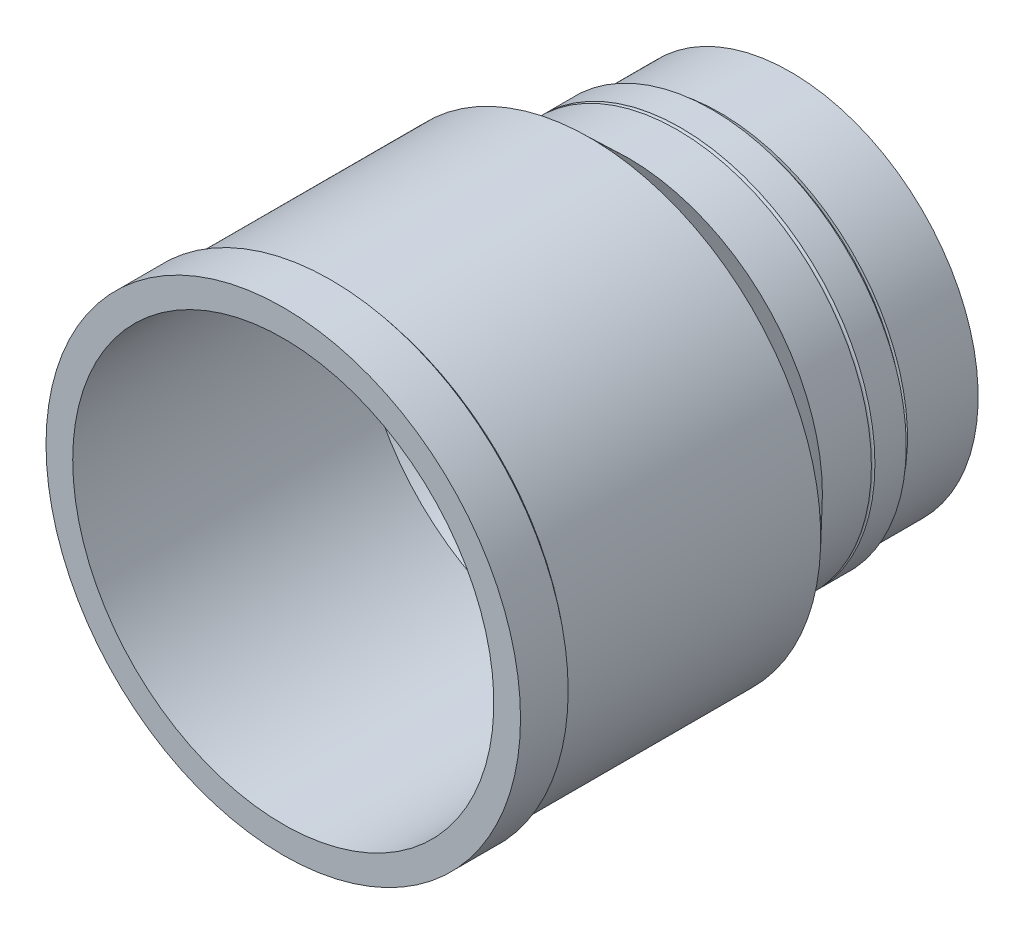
ISO-10303-21;
HEADER;
FILE_DESCRIPTION(('STEP AP214'),'2;1');
FILE_NAME('part.step','',(''),(''),'','','');
FILE_SCHEMA(('AUTOMOTIVE_DESIGN { 1 0 10303 214 1 1 1 1 }'));
ENDSEC;
DATA;
#1=APPLICATION_CONTEXT('core data for automotive mechanical design processes');
#2=APPLICATION_PROTOCOL_DEFINITION('international standard','automotive_design',2000,#1);
#3=PRODUCT_CONTEXT('',#1,'mechanical');
#4=PRODUCT('Part','Part','',(#3));
#5=PRODUCT_RELATED_PRODUCT_CATEGORY('part','',(#4));
#6=PRODUCT_DEFINITION_FORMATION('','',#4);
#7=PRODUCT_DEFINITION_CONTEXT('part definition',#1,'design');
#8=PRODUCT_DEFINITION('design','',#6,#7);
#9=PRODUCT_DEFINITION_SHAPE('','',#8);
#10=(LENGTH_UNIT() NAMED_UNIT(*) SI_UNIT(.MILLI.,.METRE.));
#11=(NAMED_UNIT(*) PLANE_ANGLE_UNIT() SI_UNIT($,.RADIAN.));
#12=(NAMED_UNIT(*) SI_UNIT($,.STERADIAN.) SOLID_ANGLE_UNIT());
#13=UNCERTAINTY_MEASURE_WITH_UNIT(LENGTH_MEASURE(1.E-05),#10,'distance_accuracy_value','');
#14=(GEOMETRIC_REPRESENTATION_CONTEXT(3) GLOBAL_UNCERTAINTY_ASSIGNED_CONTEXT((#13)) GLOBAL_UNIT_ASSIGNED_CONTEXT((#10,
#11,#12)) REPRESENTATION_CONTEXT('',''));
#15=CARTESIAN_POINT('',(0.,0.,0.));
#16=DIRECTION('',(0.,0.,1.));
#17=DIRECTION('',(1.,0.,0.));
#18=AXIS2_PLACEMENT_3D('',#15,#16,#17);
#19=CARTESIAN_POINT('',(0.,0.,-227.838));
#20=DIRECTION('',(0.,0.,-1.));
#21=DIRECTION('',(-1.,0.,0.));
#22=AXIS2_PLACEMENT_3D('',#19,#20,#21);
#23=TOROIDAL_SURFACE('',#22,111.76,1.01599999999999);
#24=CARTESIAN_POINT('',(0.,0.,-228.854));
#25=DIRECTION('',(0.,0.,-1.));
#26=DIRECTION('',(-1.,0.,0.));
#27=AXIS2_PLACEMENT_3D('',#24,#25,#26);
#28=CIRCLE('',#27,111.76);
#29=CARTESIAN_POINT('',(-111.76,0.,-228.854));
#30=VERTEX_POINT('',#29);
#31=EDGE_CURVE('E106',#30,#30,#28,.T.);
#32=ORIENTED_EDGE('',*,*,#31,.F.);
#33=EDGE_LOOP('',(#32));
#34=FACE_BOUND('',#33,.T.);
#35=CARTESIAN_POINT('',(0.,0.,-226.822));
#36=DIRECTION('',(0.,0.,-1.));
#37=DIRECTION('',(-1.,0.,0.));
#38=AXIS2_PLACEMENT_3D('',#35,#36,#37);
#39=CIRCLE('',#38,111.76);
#40=CARTESIAN_POINT('',(-111.76,0.,-226.822));
#41=VERTEX_POINT('',#40);
#42=EDGE_CURVE('E10',#41,#41,#39,.T.);
#43=ORIENTED_EDGE('',*,*,#42,.T.);
#44=EDGE_LOOP('',(#43));
#45=FACE_BOUND('',#44,.T.);
#46=ADVANCED_FACE('F37',(#34,#45),#23,.F.);
#47=CARTESIAN_POINT('',(0.,0.,-87.9139376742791));
#48=DIRECTION('',(0.,0.,-1.));
#49=DIRECTION('',(-1.,0.,0.));
#50=AXIS2_PLACEMENT_3D('',#47,#48,#49);
#51=CYLINDRICAL_SURFACE('',#50,111.76);
#52=CARTESIAN_POINT('',(0.,0.,-198.628));
#53=DIRECTION('',(0.,0.,-1.));
#54=DIRECTION('',(-1.,0.,0.));
#55=AXIS2_PLACEMENT_3D('',#52,#53,#54);
#56=CIRCLE('',#55,111.76);
#57=CARTESIAN_POINT('',(-111.76,0.,-198.628));
#58=VERTEX_POINT('',#57);
#59=EDGE_CURVE('E44',#58,#58,#56,.T.);
#60=ORIENTED_EDGE('',*,*,#59,.T.);
#61=EDGE_LOOP('',(#60));
#62=FACE_BOUND('',#61,.T.);
#63=ORIENTED_EDGE('',*,*,#42,.F.);
#64=EDGE_LOOP('',(#63));
#65=FACE_BOUND('',#64,.T.);
#66=ADVANCED_FACE('F113',(#62,#65),#51,.T.);
#67=CARTESIAN_POINT('',(0.,0.,-198.628));
#68=DIRECTION('',(0.,0.,1.));
#69=DIRECTION('',(1.,0.,0.));
#70=AXIS2_PLACEMENT_3D('',#67,#68,#69);
#71=CONICAL_SURFACE('',#70,111.76,0.763375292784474);
#72=CARTESIAN_POINT('',(0.,0.,-176.53));
#73=DIRECTION('',(0.,0.,-1.));
#74=DIRECTION('',(-1.,0.,0.));
#75=AXIS2_PLACEMENT_3D('',#72,#73,#74);
#76=CIRCLE('',#75,132.9055);
#77=CARTESIAN_POINT('',(-132.9055,0.,-176.53));
#78=VERTEX_POINT('',#77);
#79=EDGE_CURVE('E50',#78,#78,#76,.T.);
#80=ORIENTED_EDGE('',*,*,#79,.T.);
#81=EDGE_LOOP('',(#80));
#82=FACE_BOUND('',#81,.T.);
#83=ORIENTED_EDGE('',*,*,#59,.F.);
#84=EDGE_LOOP('',(#83));
#85=FACE_BOUND('',#84,.T.);
#86=ADVANCED_FACE('F117',(#82,#85),#71,.T.);
#87=CARTESIAN_POINT('',(0.,0.,-87.9139376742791));
#88=DIRECTION('',(0.,0.,-1.));
#89=DIRECTION('',(-1.,0.,0.));
#90=AXIS2_PLACEMENT_3D('',#87,#88,#89);
#91=CYLINDRICAL_SURFACE('',#90,132.9055);
#92=CARTESIAN_POINT('',(0.,0.,-30.48));
#93=DIRECTION('',(0.,0.,-1.));
#94=DIRECTION('',(-1.,0.,0.));
#95=AXIS2_PLACEMENT_3D('',#92,#93,#94);
#96=CIRCLE('',#95,132.9055);
#97=CARTESIAN_POINT('',(-132.9055,0.,-30.48));
#98=VERTEX_POINT('',#97);
#99=EDGE_CURVE('E55',#98,#98,#96,.T.);
#100=ORIENTED_EDGE('',*,*,#99,.T.);
#101=EDGE_LOOP('',(#100));
#102=FACE_BOUND('',#101,.T.);
#103=ORIENTED_EDGE('',*,*,#79,.F.);
#104=EDGE_LOOP('',(#103));
#105=FACE_BOUND('',#104,.T.);
#106=ADVANCED_FACE('F121',(#102,#105),#91,.T.);
#107=CARTESIAN_POINT('',(0.,0.,-27.432));
#108=DIRECTION('',(0.,0.,1.));
#109=DIRECTION('',(1.,0.,0.));
#110=AXIS2_PLACEMENT_3D('',#107,#108,#109);
#111=CONICAL_SURFACE('',#110,136.5885,0.879459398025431);
#112=ORIENTED_EDGE('',*,*,#99,.F.);
#113=EDGE_LOOP('',(#112));
#114=FACE_BOUND('',#113,.T.);
#115=CARTESIAN_POINT('',(0.,0.,-27.432));
#116=DIRECTION('',(0.,0.,-1.));
#117=DIRECTION('',(-1.,0.,0.));
#118=AXIS2_PLACEMENT_3D('',#115,#116,#117);
#119=CIRCLE('',#118,136.5885);
#120=CARTESIAN_POINT('',(-136.5885,0.,-27.432));
#121=VERTEX_POINT('',#120);
#122=EDGE_CURVE('E60',#121,#121,#119,.T.);
#123=ORIENTED_EDGE('',*,*,#122,.T.);
#124=EDGE_LOOP('',(#123));
#125=FACE_BOUND('',#124,.T.);
#126=ADVANCED_FACE('F128',(#114,#125),#111,.T.);
#127=CARTESIAN_POINT('',(0.,0.,-87.9139376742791));
#128=DIRECTION('',(0.,0.,-1.));
#129=DIRECTION('',(-1.,0.,0.));
#130=AXIS2_PLACEMENT_3D('',#127,#128,#129);
#131=CYLINDRICAL_SURFACE('',#130,136.5885);
#132=ORIENTED_EDGE('',*,*,#122,.F.);
#133=EDGE_LOOP('',(#132));
#134=FACE_BOUND('',#133,.T.);
#135=CARTESIAN_POINT('',(0.,0.,0.));
#136=DIRECTION('',(0.,0.,-1.));
#137=DIRECTION('',(-1.,0.,0.));
#138=AXIS2_PLACEMENT_3D('',#135,#136,#137);
#139=CIRCLE('',#138,136.5885);
#140=CARTESIAN_POINT('',(-136.5885,0.,0.));
#141=VERTEX_POINT('',#140);
#142=EDGE_CURVE('E63',#141,#141,#139,.T.);
#143=ORIENTED_EDGE('',*,*,#142,.T.);
#144=EDGE_LOOP('',(#143));
#145=FACE_BOUND('',#144,.T.);
#146=ADVANCED_FACE('F132',(#134,#145),#131,.T.);
#147=CARTESIAN_POINT('',(0.,93.6831624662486,0.));
#148=DIRECTION('',(0.,0.,1.));
#149=DIRECTION('',(1.,0.,0.));
#150=AXIS2_PLACEMENT_3D('',#147,#148,#149);
#151=PLANE('',#150);
#152=CARTESIAN_POINT('',(0.,0.,0.));
#153=DIRECTION('',(0.,0.,-1.));
#154=DIRECTION('',(-1.,0.,0.));
#155=AXIS2_PLACEMENT_3D('',#152,#153,#154);
#156=CIRCLE('',#155,121.212859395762);
#157=CARTESIAN_POINT('',(-121.212859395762,0.,0.));
#158=VERTEX_POINT('',#157);
#159=EDGE_CURVE('E66',#158,#158,#156,.T.);
#160=ORIENTED_EDGE('',*,*,#159,.T.);
#161=EDGE_LOOP('',(#160));
#162=FACE_BOUND('',#161,.T.);
#163=ORIENTED_EDGE('',*,*,#142,.F.);
#164=EDGE_LOOP('',(#163));
#165=FACE_BOUND('',#164,.T.);
#166=ADVANCED_FACE('F136',(#162,#165),#151,.T.);
#167=CARTESIAN_POINT('',(0.,0.,-87.9139376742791));
#168=DIRECTION('',(0.,0.,-1.));
#169=DIRECTION('',(-1.,0.,0.));
#170=AXIS2_PLACEMENT_3D('',#167,#168,#169);
#171=CYLINDRICAL_SURFACE('',#170,121.212859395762);
#172=ORIENTED_EDGE('',*,*,#159,.F.);
#173=EDGE_LOOP('',(#172));
#174=FACE_BOUND('',#173,.T.);
#175=CARTESIAN_POINT('',(0.,0.,-164.594221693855));
#176=DIRECTION('',(0.,0.,-1.));
#177=DIRECTION('',(-1.,0.,0.));
#178=AXIS2_PLACEMENT_3D('',#175,#176,#177);
#179=CIRCLE('',#178,121.212859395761);
#180=CARTESIAN_POINT('',(-121.212859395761,0.,-164.594221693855));
#181=VERTEX_POINT('',#180);
#182=EDGE_CURVE('E69',#181,#181,#179,.T.);
#183=ORIENTED_EDGE('',*,*,#182,.T.);
#184=EDGE_LOOP('',(#183));
#185=FACE_BOUND('',#184,.T.);
#186=ADVANCED_FACE('F140',(#174,#185),#171,.F.);
#187=CARTESIAN_POINT('',(0.,0.,-228.6));
#188=DIRECTION('',(0.,0.,1.));
#189=DIRECTION('',(1.,0.,0.));
#190=AXIS2_PLACEMENT_3D('',#187,#188,#189);
#191=CONICAL_SURFACE('',#190,84.7164650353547,0.518223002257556);
#192=ORIENTED_EDGE('',*,*,#182,.F.);
#193=EDGE_LOOP('',(#192));
#194=FACE_BOUND('',#193,.T.);
#195=CARTESIAN_POINT('',(0.,0.,-228.6));
#196=DIRECTION('',(0.,0.,-1.));
#197=DIRECTION('',(-1.,0.,0.));
#198=AXIS2_PLACEMENT_3D('',#195,#196,#197);
#199=CIRCLE('',#198,84.7164650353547);
#200=CARTESIAN_POINT('',(-84.7164650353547,0.,-228.6));
#201=VERTEX_POINT('',#200);
#202=EDGE_CURVE('E72',#201,#201,#199,.T.);
#203=ORIENTED_EDGE('',*,*,#202,.T.);
#204=EDGE_LOOP('',(#203));
#205=FACE_BOUND('',#204,.T.);
#206=ADVANCED_FACE('F144',(#194,#205),#191,.F.);
#207=CARTESIAN_POINT('',(0.,0.,-87.9139376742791));
#208=DIRECTION('',(0.,0.,-1.));
#209=DIRECTION('',(-1.,0.,0.));
#210=AXIS2_PLACEMENT_3D('',#207,#208,#209);
#211=CYLINDRICAL_SURFACE('',#210,84.7164650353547);
#212=ORIENTED_EDGE('',*,*,#202,.F.);
#213=EDGE_LOOP('',(#212));
#214=FACE_BOUND('',#213,.T.);
#215=CARTESIAN_POINT('',(0.,0.,-254.));
#216=DIRECTION('',(0.,0.,-1.));
#217=DIRECTION('',(-1.,0.,0.));
#218=AXIS2_PLACEMENT_3D('',#215,#216,#217);
#219=CIRCLE('',#218,84.7164650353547);
#220=CARTESIAN_POINT('',(-84.7164650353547,0.,-254.));
#221=VERTEX_POINT('',#220);
#222=EDGE_CURVE('E75',#221,#221,#219,.T.);
#223=ORIENTED_EDGE('',*,*,#222,.T.);
#224=EDGE_LOOP('',(#223));
#225=FACE_BOUND('',#224,.T.);
#226=ADVANCED_FACE('F148',(#214,#225),#211,.F.);
#227=CARTESIAN_POINT('',(0.,93.6831624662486,-254.));
#228=DIRECTION('',(0.,0.,1.));
#229=DIRECTION('',(1.,0.,0.));
#230=AXIS2_PLACEMENT_3D('',#227,#228,#229);
#231=PLANE('',#230);
#232=ORIENTED_EDGE('',*,*,#222,.F.);
#233=EDGE_LOOP('',(#232));
#234=FACE_BOUND('',#233,.T.);
#235=CARTESIAN_POINT('',(0.,0.,-254.));
#236=DIRECTION('',(0.,0.,-1.));
#237=DIRECTION('',(-1.,0.,0.));
#238=AXIS2_PLACEMENT_3D('',#235,#236,#237);
#239=CIRCLE('',#238,97.8419678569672);
#240=CARTESIAN_POINT('',(-97.8419678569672,0.,-254.));
#241=VERTEX_POINT('',#240);
#242=EDGE_CURVE('E79',#241,#241,#239,.T.);
#243=ORIENTED_EDGE('',*,*,#242,.T.);
#244=EDGE_LOOP('',(#243));
#245=FACE_BOUND('',#244,.T.);
#246=ADVANCED_FACE('F152',(#234,#245),#231,.F.);
#247=CARTESIAN_POINT('',(0.,0.,-87.9139376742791));
#248=DIRECTION('',(0.,0.,-1.));
#249=DIRECTION('',(-1.,0.,0.));
#250=AXIS2_PLACEMENT_3D('',#247,#248,#249);
#251=CYLINDRICAL_SURFACE('',#250,97.8419678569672);
#252=CARTESIAN_POINT('',(0.,0.,-292.1));
#253=DIRECTION('',(0.,0.,-1.));
#254=DIRECTION('',(-1.,0.,0.));
#255=AXIS2_PLACEMENT_3D('',#252,#253,#254);
#256=CIRCLE('',#255,97.8419678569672);
#257=CARTESIAN_POINT('',(-97.8419678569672,0.,-292.1));
#258=VERTEX_POINT('',#257);
#259=EDGE_CURVE('E83',#258,#258,#256,.T.);
#260=ORIENTED_EDGE('',*,*,#259,.T.);
#261=EDGE_LOOP('',(#260));
#262=FACE_BOUND('',#261,.T.);
#263=ORIENTED_EDGE('',*,*,#242,.F.);
#264=EDGE_LOOP('',(#263));
#265=FACE_BOUND('',#264,.T.);
#266=ADVANCED_FACE('F156',(#262,#265),#251,.F.);
#267=CARTESIAN_POINT('',(0.,93.6831624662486,-292.1));
#268=DIRECTION('',(0.,0.,1.));
#269=DIRECTION('',(1.,0.,0.));
#270=AXIS2_PLACEMENT_3D('',#267,#268,#269);
#271=PLANE('',#270);
#272=ORIENTED_EDGE('',*,*,#259,.F.);
#273=EDGE_LOOP('',(#272));
#274=FACE_BOUND('',#273,.T.);
#275=CARTESIAN_POINT('',(0.,0.,-292.1));
#276=DIRECTION('',(0.,0.,-1.));
#277=DIRECTION('',(-1.,0.,0.));
#278=AXIS2_PLACEMENT_3D('',#275,#276,#277);
#279=CIRCLE('',#278,107.95);
#280=CARTESIAN_POINT('',(-107.95,0.,-292.1));
#281=VERTEX_POINT('',#280);
#282=EDGE_CURVE('E86',#281,#281,#279,.T.);
#283=ORIENTED_EDGE('',*,*,#282,.T.);
#284=EDGE_LOOP('',(#283));
#285=FACE_BOUND('',#284,.T.);
#286=ADVANCED_FACE('F160',(#274,#285),#271,.F.);
#287=CARTESIAN_POINT('',(0.,0.,-87.9139376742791));
#288=DIRECTION('',(0.,0.,-1.));
#289=DIRECTION('',(-1.,0.,0.));
#290=AXIS2_PLACEMENT_3D('',#287,#288,#289);
#291=CYLINDRICAL_SURFACE('',#290,107.95);
#292=ORIENTED_EDGE('',*,*,#282,.F.);
#293=EDGE_LOOP('',(#292));
#294=FACE_BOUND('',#293,.T.);
#295=CARTESIAN_POINT('',(0.,0.,-251.4092));
#296=DIRECTION('',(0.,0.,-1.));
#297=DIRECTION('',(-1.,0.,0.));
#298=AXIS2_PLACEMENT_3D('',#295,#296,#297);
#299=CIRCLE('',#298,107.95);
#300=CARTESIAN_POINT('',(-107.95,0.,-251.4092));
#301=VERTEX_POINT('',#300);
#302=EDGE_CURVE('E90',#301,#301,#299,.T.);
#303=ORIENTED_EDGE('',*,*,#302,.T.);
#304=EDGE_LOOP('',(#303));
#305=FACE_BOUND('',#304,.T.);
#306=ADVANCED_FACE('F164',(#294,#305),#291,.T.);
#307=CARTESIAN_POINT('',(0.,93.6831624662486,-251.4092));
#308=DIRECTION('',(0.,0.,-1.));
#309=DIRECTION('',(-1.,0.,0.));
#310=AXIS2_PLACEMENT_3D('',#307,#308,#309);
#311=PLANE('',#310);
#312=ORIENTED_EDGE('',*,*,#302,.F.);
#313=EDGE_LOOP('',(#312));
#314=FACE_BOUND('',#313,.T.);
#315=CARTESIAN_POINT('',(0.,0.,-251.4092));
#316=DIRECTION('',(0.,0.,-1.));
#317=DIRECTION('',(-1.,0.,0.));
#318=AXIS2_PLACEMENT_3D('',#315,#316,#317);
#319=CIRCLE('',#318,106.072401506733);
#320=CARTESIAN_POINT('',(-106.072401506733,0.,-251.4092));
#321=VERTEX_POINT('',#320);
#322=EDGE_CURVE('E94',#321,#321,#319,.T.);
#323=ORIENTED_EDGE('',*,*,#322,.T.);
#324=EDGE_LOOP('',(#323));
#325=FACE_BOUND('',#324,.T.);
#326=ADVANCED_FACE('F168',(#314,#325),#311,.F.);
#327=CARTESIAN_POINT('',(0.,0.,-87.9139376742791));
#328=DIRECTION('',(0.,0.,-1.));
#329=DIRECTION('',(-1.,0.,0.));
#330=AXIS2_PLACEMENT_3D('',#327,#328,#329);
#331=CYLINDRICAL_SURFACE('',#330,106.072401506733);
#332=ORIENTED_EDGE('',*,*,#322,.F.);
#333=EDGE_LOOP('',(#332));
#334=FACE_BOUND('',#333,.T.);
#335=CARTESIAN_POINT('',(0.,0.,-246.888));
#336=DIRECTION('',(0.,0.,-1.));
#337=DIRECTION('',(-1.,0.,0.));
#338=AXIS2_PLACEMENT_3D('',#335,#336,#337);
#339=CIRCLE('',#338,106.072401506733);
#340=CARTESIAN_POINT('',(-106.072401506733,0.,-246.888));
#341=VERTEX_POINT('',#340);
#342=EDGE_CURVE('E98',#341,#341,#339,.T.);
#343=ORIENTED_EDGE('',*,*,#342,.T.);
#344=EDGE_LOOP('',(#343));
#345=FACE_BOUND('',#344,.T.);
#346=ADVANCED_FACE('F172',(#334,#345),#331,.T.);
#347=CARTESIAN_POINT('',(0.,93.6831624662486,-246.888));
#348=DIRECTION('',(0.,0.,1.));
#349=DIRECTION('',(1.,0.,0.));
#350=AXIS2_PLACEMENT_3D('',#347,#348,#349);
#351=PLANE('',#350);
#352=ORIENTED_EDGE('',*,*,#342,.F.);
#353=EDGE_LOOP('',(#352));
#354=FACE_BOUND('',#353,.T.);
#355=CARTESIAN_POINT('',(0.,0.,-246.888));
#356=DIRECTION('',(0.,0.,-1.));
#357=DIRECTION('',(-1.,0.,0.));
#358=AXIS2_PLACEMENT_3D('',#355,#356,#357);
#359=CIRCLE('',#358,111.76);
#360=CARTESIAN_POINT('',(-111.76,0.,-246.888));
#361=VERTEX_POINT('',#360);
#362=EDGE_CURVE('E102',#361,#361,#359,.T.);
#363=ORIENTED_EDGE('',*,*,#362,.T.);
#364=EDGE_LOOP('',(#363));
#365=FACE_BOUND('',#364,.T.);
#366=ADVANCED_FACE('F176',(#354,#365),#351,.F.);
#367=CARTESIAN_POINT('',(0.,0.,-87.9139376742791));
#368=DIRECTION('',(0.,0.,-1.));
#369=DIRECTION('',(-1.,0.,0.));
#370=AXIS2_PLACEMENT_3D('',#367,#368,#369);
#371=CYLINDRICAL_SURFACE('',#370,111.76);
#372=ORIENTED_EDGE('',*,*,#362,.F.);
#373=EDGE_LOOP('',(#372));
#374=FACE_BOUND('',#373,.T.);
#375=ORIENTED_EDGE('',*,*,#31,.T.);
#376=EDGE_LOOP('',(#375));
#377=FACE_BOUND('',#376,.T.);
#378=ADVANCED_FACE('F110',(#374,#377),#371,.T.);
#379=CLOSED_SHELL('',(#46,#66,#86,#106,#126,#146,#166,#186,#206,#226,#246,#266,#286,#306,#326,
#346,#366,#378));
#380=MANIFOLD_SOLID_BREP('B2',#379);
#381=ADVANCED_BREP_SHAPE_REPRESENTATION('',(#18,#380),#14);
#382=SHAPE_DEFINITION_REPRESENTATION(#9,#381);
ENDSEC;
END-ISO-10303-21;
